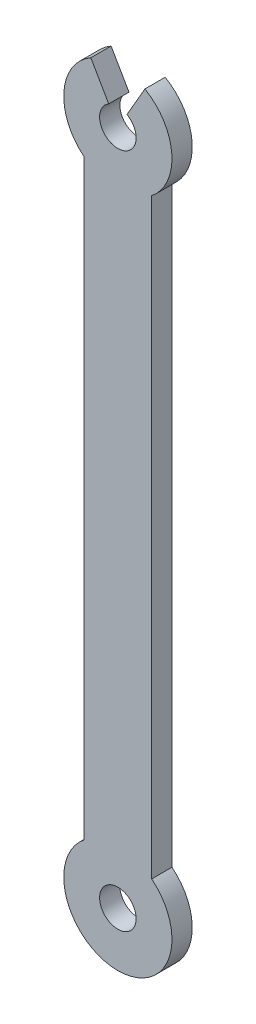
ISO-10303-21;
HEADER;
FILE_DESCRIPTION(('STEP AP214'),'2;1');
FILE_NAME('part.step','',(''),(''),'','','');
FILE_SCHEMA(('AUTOMOTIVE_DESIGN { 1 0 10303 214 1 1 1 1 }'));
ENDSEC;
DATA;
#1=APPLICATION_CONTEXT('core data for automotive mechanical design processes');
#2=APPLICATION_PROTOCOL_DEFINITION('international standard','automotive_design',2000,#1);
#3=PRODUCT_CONTEXT('',#1,'mechanical');
#4=PRODUCT('Part','Part','',(#3));
#5=PRODUCT_RELATED_PRODUCT_CATEGORY('part','',(#4));
#6=PRODUCT_DEFINITION_FORMATION('','',#4);
#7=PRODUCT_DEFINITION_CONTEXT('part definition',#1,'design');
#8=PRODUCT_DEFINITION('design','',#6,#7);
#9=PRODUCT_DEFINITION_SHAPE('','',#8);
#10=(LENGTH_UNIT() NAMED_UNIT(*) SI_UNIT(.MILLI.,.METRE.));
#11=(NAMED_UNIT(*) PLANE_ANGLE_UNIT() SI_UNIT($,.RADIAN.));
#12=(NAMED_UNIT(*) SI_UNIT($,.STERADIAN.) SOLID_ANGLE_UNIT());
#13=UNCERTAINTY_MEASURE_WITH_UNIT(LENGTH_MEASURE(1.E-05),#10,'distance_accuracy_value','');
#14=(GEOMETRIC_REPRESENTATION_CONTEXT(3) GLOBAL_UNCERTAINTY_ASSIGNED_CONTEXT((#13)) GLOBAL_UNIT_ASSIGNED_CONTEXT((#10,
#11,#12)) REPRESENTATION_CONTEXT('',''));
#15=CARTESIAN_POINT('',(0.,0.,0.));
#16=DIRECTION('',(0.,0.,1.));
#17=DIRECTION('',(1.,0.,0.));
#18=AXIS2_PLACEMENT_3D('',#15,#16,#17);
#19=CARTESIAN_POINT('',(0.,0.,1.5));
#20=DIRECTION('',(-0.866025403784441,-0.499999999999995,0.));
#21=DIRECTION('',(0.499999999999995,-0.866025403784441,0.));
#22=AXIS2_PLACEMENT_3D('',#19,#20,#21);
#23=PLANE('',#22);
#24=DIRECTION('',(-0.499999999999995,0.866025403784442,0.));
#25=VECTOR('',#24,1.);
#26=CARTESIAN_POINT('',(0.,0.,0.));
#27=LINE('',#26,#25);
#28=CARTESIAN_POINT('',(-0.674999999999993,1.169134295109,0.));
#29=VERTEX_POINT('',#28);
#30=CARTESIAN_POINT('',(-1.99999999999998,3.46410161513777,0.));
#31=VERTEX_POINT('',#30);
#32=EDGE_CURVE('E147',#29,#31,#27,.T.);
#33=ORIENTED_EDGE('',*,*,#32,.T.);
#34=DIRECTION('',(0.,0.,-1.));
#35=VECTOR('',#34,1.);
#36=CARTESIAN_POINT('',(-1.99999999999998,3.46410161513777,1.5));
#37=LINE('',#36,#35);
#38=CARTESIAN_POINT('',(-1.99999999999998,3.46410161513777,1.5));
#39=VERTEX_POINT('',#38);
#40=EDGE_CURVE('E11',#39,#31,#37,.T.);
#41=ORIENTED_EDGE('',*,*,#40,.F.);
#42=DIRECTION('',(-0.499999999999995,0.866025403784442,0.));
#43=VECTOR('',#42,1.);
#44=CARTESIAN_POINT('',(0.,0.,1.5));
#45=LINE('',#44,#43);
#46=CARTESIAN_POINT('',(-0.674999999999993,1.169134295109,1.5));
#47=VERTEX_POINT('',#46);
#48=EDGE_CURVE('E210',#47,#39,#45,.T.);
#49=ORIENTED_EDGE('',*,*,#48,.F.);
#50=DIRECTION('',(0.,0.,-1.));
#51=VECTOR('',#50,1.);
#52=CARTESIAN_POINT('',(-0.674999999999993,1.169134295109,1.5));
#53=LINE('',#52,#51);
#54=EDGE_CURVE('E59',#47,#29,#53,.T.);
#55=ORIENTED_EDGE('',*,*,#54,.T.);
#56=EDGE_LOOP('',(#33,#41,#49,#55));
#57=FACE_BOUND('',#56,.T.);
#58=ADVANCED_FACE('F41',(#57),#23,.F.);
#59=CARTESIAN_POINT('',(0.,0.,1.5));
#60=DIRECTION('',(0.,0.,-1.));
#61=DIRECTION('',(-1.,0.,0.));
#62=AXIS2_PLACEMENT_3D('',#59,#60,#61);
#63=CYLINDRICAL_SURFACE('',#62,4.);
#64=CARTESIAN_POINT('',(0.,0.,0.));
#65=DIRECTION('',(0.,0.,1.));
#66=DIRECTION('',(1.,0.,0.));
#67=AXIS2_PLACEMENT_3D('',#64,#65,#66);
#68=CIRCLE('',#67,4.);
#69=CARTESIAN_POINT('',(-2.5,-3.1224989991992,0.));
#70=VERTEX_POINT('',#69);
#71=EDGE_CURVE('E150',#31,#70,#68,.T.);
#72=ORIENTED_EDGE('',*,*,#71,.T.);
#73=DIRECTION('',(0.,0.,-1.));
#74=VECTOR('',#73,1.);
#75=CARTESIAN_POINT('',(-2.5,-3.1224989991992,1.5));
#76=LINE('',#75,#74);
#77=CARTESIAN_POINT('',(-2.5,-3.1224989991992,1.5));
#78=VERTEX_POINT('',#77);
#79=EDGE_CURVE('E51',#78,#70,#76,.T.);
#80=ORIENTED_EDGE('',*,*,#79,.F.);
#81=CARTESIAN_POINT('',(0.,0.,1.5));
#82=DIRECTION('',(0.,0.,1.));
#83=DIRECTION('',(1.,0.,0.));
#84=AXIS2_PLACEMENT_3D('',#81,#82,#83);
#85=CIRCLE('',#84,4.);
#86=EDGE_CURVE('E97',#39,#78,#85,.T.);
#87=ORIENTED_EDGE('',*,*,#86,.F.);
#88=ORIENTED_EDGE('',*,*,#40,.T.);
#89=EDGE_LOOP('',(#72,#80,#87,#88));
#90=FACE_BOUND('',#89,.T.);
#91=ADVANCED_FACE('F194',(#90),#63,.T.);
#92=CARTESIAN_POINT('',(-2.5,0.,1.5));
#93=DIRECTION('',(-1.,0.,0.));
#94=DIRECTION('',(0.,-1.,0.));
#95=AXIS2_PLACEMENT_3D('',#92,#93,#94);
#96=PLANE('',#95);
#97=DIRECTION('',(0.,1.,0.));
#98=VECTOR('',#97,1.);
#99=CARTESIAN_POINT('',(-2.5,0.,0.));
#100=LINE('',#99,#98);
#101=CARTESIAN_POINT('',(-2.5,-46.8775010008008,0.));
#102=VERTEX_POINT('',#101);
#103=EDGE_CURVE('E154',#102,#70,#100,.T.);
#104=ORIENTED_EDGE('',*,*,#103,.F.);
#105=DIRECTION('',(0.,0.,-1.));
#106=VECTOR('',#105,1.);
#107=CARTESIAN_POINT('',(-2.5,-46.8775010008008,1.5));
#108=LINE('',#107,#106);
#109=CARTESIAN_POINT('',(-2.5,-46.8775010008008,1.5));
#110=VERTEX_POINT('',#109);
#111=EDGE_CURVE('E185',#110,#102,#108,.T.);
#112=ORIENTED_EDGE('',*,*,#111,.F.);
#113=DIRECTION('',(0.,1.,0.));
#114=VECTOR('',#113,1.);
#115=CARTESIAN_POINT('',(-2.5,0.,1.5));
#116=LINE('',#115,#114);
#117=EDGE_CURVE('E193',#110,#78,#116,.T.);
#118=ORIENTED_EDGE('',*,*,#117,.T.);
#119=ORIENTED_EDGE('',*,*,#79,.T.);
#120=EDGE_LOOP('',(#104,#112,#118,#119));
#121=FACE_BOUND('',#120,.T.);
#122=ADVANCED_FACE('F191',(#121),#96,.T.);
#123=CARTESIAN_POINT('',(0.,-50.,1.5));
#124=DIRECTION('',(0.,0.,-1.));
#125=DIRECTION('',(-1.,0.,0.));
#126=AXIS2_PLACEMENT_3D('',#123,#124,#125);
#127=CYLINDRICAL_SURFACE('',#126,4.);
#128=CARTESIAN_POINT('',(0.,-50.,0.));
#129=DIRECTION('',(0.,0.,1.));
#130=DIRECTION('',(1.,0.,0.));
#131=AXIS2_PLACEMENT_3D('',#128,#129,#130);
#132=CIRCLE('',#131,4.);
#133=CARTESIAN_POINT('',(2.50000000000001,-46.8775010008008,0.));
#134=VERTEX_POINT('',#133);
#135=EDGE_CURVE('E158',#102,#134,#132,.T.);
#136=ORIENTED_EDGE('',*,*,#135,.T.);
#137=DIRECTION('',(0.,0.,-1.));
#138=VECTOR('',#137,1.);
#139=CARTESIAN_POINT('',(2.50000000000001,-46.8775010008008,1.5));
#140=LINE('',#139,#138);
#141=CARTESIAN_POINT('',(2.50000000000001,-46.8775010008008,1.5));
#142=VERTEX_POINT('',#141);
#143=EDGE_CURVE('E182',#142,#134,#140,.T.);
#144=ORIENTED_EDGE('',*,*,#143,.F.);
#145=CARTESIAN_POINT('',(0.,-50.,1.5));
#146=DIRECTION('',(0.,0.,1.));
#147=DIRECTION('',(1.,0.,0.));
#148=AXIS2_PLACEMENT_3D('',#145,#146,#147);
#149=CIRCLE('',#148,4.);
#150=EDGE_CURVE('E204',#110,#142,#149,.T.);
#151=ORIENTED_EDGE('',*,*,#150,.F.);
#152=ORIENTED_EDGE('',*,*,#111,.T.);
#153=EDGE_LOOP('',(#136,#144,#151,#152));
#154=FACE_BOUND('',#153,.T.);
#155=ADVANCED_FACE('F202',(#154),#127,.T.);
#156=CARTESIAN_POINT('',(2.5,0.,1.5));
#157=DIRECTION('',(1.,0.,0.));
#158=DIRECTION('',(0.,1.,0.));
#159=AXIS2_PLACEMENT_3D('',#156,#157,#158);
#160=PLANE('',#159);
#161=DIRECTION('',(0.,-1.,0.));
#162=VECTOR('',#161,1.);
#163=CARTESIAN_POINT('',(2.5,0.,0.));
#164=LINE('',#163,#162);
#165=CARTESIAN_POINT('',(2.5,-3.1224989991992,0.));
#166=VERTEX_POINT('',#165);
#167=EDGE_CURVE('E162',#166,#134,#164,.T.);
#168=ORIENTED_EDGE('',*,*,#167,.F.);
#169=DIRECTION('',(0.,0.,-1.));
#170=VECTOR('',#169,1.);
#171=CARTESIAN_POINT('',(2.5,-3.1224989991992,1.5));
#172=LINE('',#171,#170);
#173=CARTESIAN_POINT('',(2.5,-3.1224989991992,1.5));
#174=VERTEX_POINT('',#173);
#175=EDGE_CURVE('E133',#174,#166,#172,.T.);
#176=ORIENTED_EDGE('',*,*,#175,.F.);
#177=DIRECTION('',(0.,-1.,0.));
#178=VECTOR('',#177,1.);
#179=CARTESIAN_POINT('',(2.5,0.,1.5));
#180=LINE('',#179,#178);
#181=EDGE_CURVE('E121',#174,#142,#180,.T.);
#182=ORIENTED_EDGE('',*,*,#181,.T.);
#183=ORIENTED_EDGE('',*,*,#143,.T.);
#184=EDGE_LOOP('',(#168,#176,#182,#183));
#185=FACE_BOUND('',#184,.T.);
#186=ADVANCED_FACE('F215',(#185),#160,.T.);
#187=CARTESIAN_POINT('',(0.,0.,1.5));
#188=DIRECTION('',(0.,0.,-1.));
#189=DIRECTION('',(-1.,0.,0.));
#190=AXIS2_PLACEMENT_3D('',#187,#188,#189);
#191=CYLINDRICAL_SURFACE('',#190,4.);
#192=CARTESIAN_POINT('',(0.,0.,0.));
#193=DIRECTION('',(0.,0.,1.));
#194=DIRECTION('',(1.,0.,0.));
#195=AXIS2_PLACEMENT_3D('',#192,#193,#194);
#196=CIRCLE('',#195,4.);
#197=CARTESIAN_POINT('',(1.99999999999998,3.46410161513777,0.));
#198=VERTEX_POINT('',#197);
#199=EDGE_CURVE('E129',#166,#198,#196,.T.);
#200=ORIENTED_EDGE('',*,*,#199,.T.);
#201=DIRECTION('',(0.,0.,-1.));
#202=VECTOR('',#201,1.);
#203=CARTESIAN_POINT('',(1.99999999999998,3.46410161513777,1.5));
#204=LINE('',#203,#202);
#205=CARTESIAN_POINT('',(1.99999999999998,3.46410161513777,1.5));
#206=VERTEX_POINT('',#205);
#207=EDGE_CURVE('E126',#206,#198,#204,.T.);
#208=ORIENTED_EDGE('',*,*,#207,.F.);
#209=CARTESIAN_POINT('',(0.,0.,1.5));
#210=DIRECTION('',(0.,0.,1.));
#211=DIRECTION('',(1.,0.,0.));
#212=AXIS2_PLACEMENT_3D('',#209,#210,#211);
#213=CIRCLE('',#212,4.);
#214=EDGE_CURVE('E114',#174,#206,#213,.T.);
#215=ORIENTED_EDGE('',*,*,#214,.F.);
#216=ORIENTED_EDGE('',*,*,#175,.T.);
#217=EDGE_LOOP('',(#200,#208,#215,#216));
#218=FACE_BOUND('',#217,.T.);
#219=ADVANCED_FACE('F127',(#218),#191,.T.);
#220=CARTESIAN_POINT('',(0.,0.,1.5));
#221=DIRECTION('',(-0.866025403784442,0.499999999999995,0.));
#222=DIRECTION('',(-0.499999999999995,-0.866025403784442,0.));
#223=AXIS2_PLACEMENT_3D('',#220,#221,#222);
#224=PLANE('',#223);
#225=DIRECTION('',(0.499999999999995,0.866025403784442,0.));
#226=VECTOR('',#225,1.);
#227=CARTESIAN_POINT('',(0.,0.,0.));
#228=LINE('',#227,#226);
#229=CARTESIAN_POINT('',(0.674999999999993,1.169134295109,0.));
#230=VERTEX_POINT('',#229);
#231=EDGE_CURVE('E168',#230,#198,#228,.T.);
#232=ORIENTED_EDGE('',*,*,#231,.F.);
#233=DIRECTION('',(0.,0.,-1.));
#234=VECTOR('',#233,1.);
#235=CARTESIAN_POINT('',(0.674999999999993,1.169134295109,1.5));
#236=LINE('',#235,#234);
#237=CARTESIAN_POINT('',(0.674999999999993,1.169134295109,1.5));
#238=VERTEX_POINT('',#237);
#239=EDGE_CURVE('E85',#238,#230,#236,.T.);
#240=ORIENTED_EDGE('',*,*,#239,.F.);
#241=DIRECTION('',(0.499999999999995,0.866025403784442,0.));
#242=VECTOR('',#241,1.);
#243=CARTESIAN_POINT('',(0.,0.,1.5));
#244=LINE('',#243,#242);
#245=EDGE_CURVE('E119',#238,#206,#244,.T.);
#246=ORIENTED_EDGE('',*,*,#245,.T.);
#247=ORIENTED_EDGE('',*,*,#207,.T.);
#248=EDGE_LOOP('',(#232,#240,#246,#247));
#249=FACE_BOUND('',#248,.T.);
#250=ADVANCED_FACE('F135',(#249),#224,.T.);
#251=CARTESIAN_POINT('',(0.,-50.,1.5));
#252=DIRECTION('',(0.,0.,-1.));
#253=DIRECTION('',(-1.,0.,0.));
#254=AXIS2_PLACEMENT_3D('',#251,#252,#253);
#255=CYLINDRICAL_SURFACE('',#254,1.35);
#256=CARTESIAN_POINT('',(0.,-50.,1.5));
#257=DIRECTION('',(0.,0.,1.));
#258=DIRECTION('',(1.,0.,0.));
#259=AXIS2_PLACEMENT_3D('',#256,#257,#258);
#260=CIRCLE('',#259,1.35);
#261=CARTESIAN_POINT('',(1.35000000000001,-50.,1.5));
#262=VERTEX_POINT('',#261);
#263=EDGE_CURVE('E175',#262,#262,#260,.T.);
#264=ORIENTED_EDGE('',*,*,#263,.T.);
#265=EDGE_LOOP('',(#264));
#266=FACE_BOUND('',#265,.T.);
#267=CARTESIAN_POINT('',(0.,-50.,0.));
#268=DIRECTION('',(0.,0.,1.));
#269=DIRECTION('',(1.,0.,0.));
#270=AXIS2_PLACEMENT_3D('',#267,#268,#269);
#271=CIRCLE('',#270,1.35);
#272=CARTESIAN_POINT('',(1.35000000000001,-50.,0.));
#273=VERTEX_POINT('',#272);
#274=EDGE_CURVE('E143',#273,#273,#271,.T.);
#275=ORIENTED_EDGE('',*,*,#274,.F.);
#276=EDGE_LOOP('',(#275));
#277=FACE_BOUND('',#276,.T.);
#278=ADVANCED_FACE('F43',(#266,#277),#255,.F.);
#279=CARTESIAN_POINT('',(0.,0.,1.5));
#280=DIRECTION('',(0.,0.,-1.));
#281=DIRECTION('',(-1.,0.,0.));
#282=AXIS2_PLACEMENT_3D('',#279,#280,#281);
#283=CYLINDRICAL_SURFACE('',#282,1.35);
#284=CARTESIAN_POINT('',(0.,0.,0.));
#285=DIRECTION('',(0.,0.,1.));
#286=DIRECTION('',(1.,0.,0.));
#287=AXIS2_PLACEMENT_3D('',#284,#285,#286);
#288=CIRCLE('',#287,1.35);
#289=EDGE_CURVE('E171',#29,#230,#288,.T.);
#290=ORIENTED_EDGE('',*,*,#289,.F.);
#291=ORIENTED_EDGE('',*,*,#54,.F.);
#292=CARTESIAN_POINT('',(0.,0.,1.5));
#293=DIRECTION('',(0.,0.,1.));
#294=DIRECTION('',(1.,0.,0.));
#295=AXIS2_PLACEMENT_3D('',#292,#293,#294);
#296=CIRCLE('',#295,1.35);
#297=EDGE_CURVE('E137',#47,#238,#296,.T.);
#298=ORIENTED_EDGE('',*,*,#297,.T.);
#299=ORIENTED_EDGE('',*,*,#239,.T.);
#300=EDGE_LOOP('',(#290,#291,#298,#299));
#301=FACE_BOUND('',#300,.T.);
#302=ADVANCED_FACE('F216',(#301),#283,.F.);
#303=CARTESIAN_POINT('',(0.,0.,1.5));
#304=DIRECTION('',(0.,0.,1.));
#305=DIRECTION('',(1.,0.,0.));
#306=AXIS2_PLACEMENT_3D('',#303,#304,#305);
#307=PLANE('',#306);
#308=ORIENTED_EDGE('',*,*,#263,.F.);
#309=EDGE_LOOP('',(#308));
#310=FACE_BOUND('',#309,.T.);
#311=ORIENTED_EDGE('',*,*,#48,.T.);
#312=ORIENTED_EDGE('',*,*,#86,.T.);
#313=ORIENTED_EDGE('',*,*,#117,.F.);
#314=ORIENTED_EDGE('',*,*,#150,.T.);
#315=ORIENTED_EDGE('',*,*,#181,.F.);
#316=ORIENTED_EDGE('',*,*,#214,.T.);
#317=ORIENTED_EDGE('',*,*,#245,.F.);
#318=ORIENTED_EDGE('',*,*,#297,.F.);
#319=EDGE_LOOP('',(#311,#312,#313,#314,#315,#316,#317,#318));
#320=FACE_BOUND('',#319,.T.);
#321=ADVANCED_FACE('F116',(#310,#320),#307,.T.);
#322=CARTESIAN_POINT('',(0.,0.,0.));
#323=DIRECTION('',(0.,0.,1.));
#324=DIRECTION('',(1.,0.,0.));
#325=AXIS2_PLACEMENT_3D('',#322,#323,#324);
#326=PLANE('',#325);
#327=ORIENTED_EDGE('',*,*,#274,.T.);
#328=EDGE_LOOP('',(#327));
#329=FACE_BOUND('',#328,.T.);
#330=ORIENTED_EDGE('',*,*,#32,.F.);
#331=ORIENTED_EDGE('',*,*,#289,.T.);
#332=ORIENTED_EDGE('',*,*,#231,.T.);
#333=ORIENTED_EDGE('',*,*,#199,.F.);
#334=ORIENTED_EDGE('',*,*,#167,.T.);
#335=ORIENTED_EDGE('',*,*,#135,.F.);
#336=ORIENTED_EDGE('',*,*,#103,.T.);
#337=ORIENTED_EDGE('',*,*,#71,.F.);
#338=EDGE_LOOP('',(#330,#331,#332,#333,#334,#335,#336,#337));
#339=FACE_BOUND('',#338,.T.);
#340=ADVANCED_FACE('F198',(#329,#339),#326,.F.);
#341=CLOSED_SHELL('',(#58,#91,#122,#155,#186,#219,#250,#278,#302,#321,#340));
#342=MANIFOLD_SOLID_BREP('B2',#341);
#343=ADVANCED_BREP_SHAPE_REPRESENTATION('',(#18,#342),#14);
#344=SHAPE_DEFINITION_REPRESENTATION(#9,#343);
ENDSEC;
END-ISO-10303-21;
